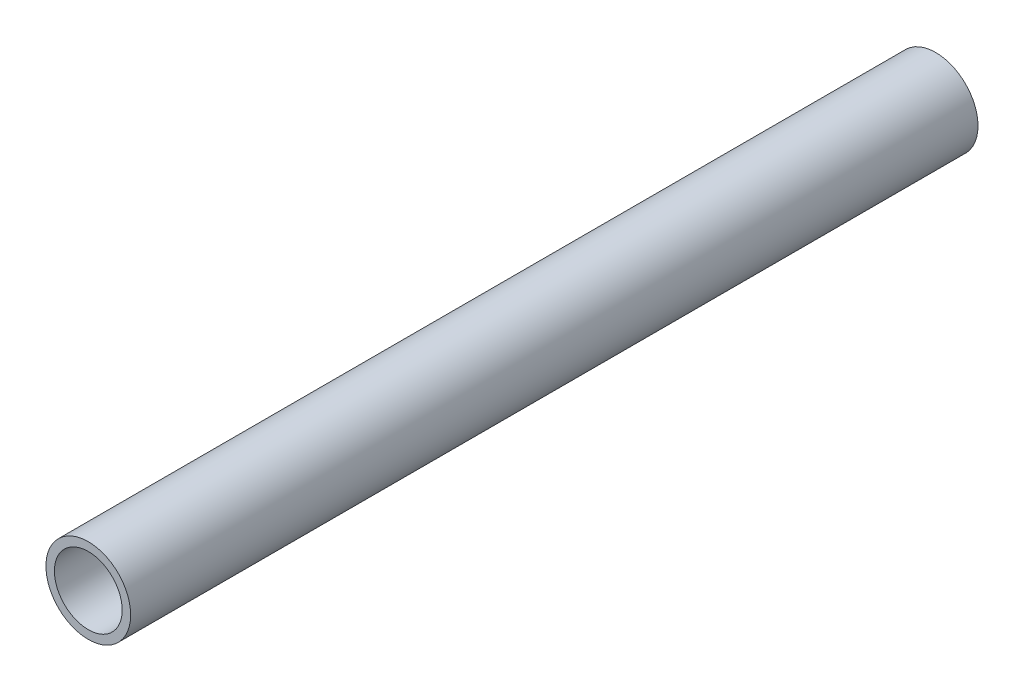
ISO-10303-21;
HEADER;
FILE_DESCRIPTION(('STEP AP214'),'2;1');
FILE_NAME('part.step','',(''),(''),'','','');
FILE_SCHEMA(('AUTOMOTIVE_DESIGN { 1 0 10303 214 1 1 1 1 }'));
ENDSEC;
DATA;
#1=APPLICATION_CONTEXT('core data for automotive mechanical design processes');
#2=APPLICATION_PROTOCOL_DEFINITION('international standard','automotive_design',2000,#1);
#3=PRODUCT_CONTEXT('',#1,'mechanical');
#4=PRODUCT('Part','Part','',(#3));
#5=PRODUCT_RELATED_PRODUCT_CATEGORY('part','',(#4));
#6=PRODUCT_DEFINITION_FORMATION('','',#4);
#7=PRODUCT_DEFINITION_CONTEXT('part definition',#1,'design');
#8=PRODUCT_DEFINITION('design','',#6,#7);
#9=PRODUCT_DEFINITION_SHAPE('','',#8);
#10=(LENGTH_UNIT() NAMED_UNIT(*) SI_UNIT(.MILLI.,.METRE.));
#11=(NAMED_UNIT(*) PLANE_ANGLE_UNIT() SI_UNIT($,.RADIAN.));
#12=(NAMED_UNIT(*) SI_UNIT($,.STERADIAN.) SOLID_ANGLE_UNIT());
#13=UNCERTAINTY_MEASURE_WITH_UNIT(LENGTH_MEASURE(1.E-05),#10,'distance_accuracy_value','');
#14=(GEOMETRIC_REPRESENTATION_CONTEXT(3) GLOBAL_UNCERTAINTY_ASSIGNED_CONTEXT((#13)) GLOBAL_UNIT_ASSIGNED_CONTEXT((#10,
#11,#12)) REPRESENTATION_CONTEXT('',''));
#15=CARTESIAN_POINT('',(0.,0.,0.));
#16=DIRECTION('',(0.,0.,1.));
#17=DIRECTION('',(1.,0.,0.));
#18=AXIS2_PLACEMENT_3D('',#15,#16,#17);
#19=CARTESIAN_POINT('',(-8.39466013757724,5.56499941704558,100.));
#20=DIRECTION('',(0.,0.,1.));
#21=DIRECTION('',(1.,0.,0.));
#22=AXIS2_PLACEMENT_3D('',#19,#20,#21);
#23=PLANE('',#22);
#24=CARTESIAN_POINT('',(-8.39466013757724,5.56499941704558,100.));
#25=DIRECTION('',(0.,0.,1.));
#26=DIRECTION('',(1.,0.,0.));
#27=AXIS2_PLACEMENT_3D('',#24,#25,#26);
#28=CIRCLE('',#27,5.);
#29=CARTESIAN_POINT('',(-3.39466013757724,5.56499941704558,100.));
#30=VERTEX_POINT('',#29);
#31=EDGE_CURVE('E10',#30,#30,#28,.T.);
#32=ORIENTED_EDGE('',*,*,#31,.T.);
#33=EDGE_LOOP('',(#32));
#34=FACE_BOUND('',#33,.T.);
#35=CARTESIAN_POINT('',(-8.39466013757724,5.56499941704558,100.));
#36=DIRECTION('',(0.,0.,1.));
#37=DIRECTION('',(1.,0.,0.));
#38=AXIS2_PLACEMENT_3D('',#35,#36,#37);
#39=CIRCLE('',#38,4.);
#40=CARTESIAN_POINT('',(-4.39466013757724,5.56499941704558,100.));
#41=VERTEX_POINT('',#40);
#42=EDGE_CURVE('E39',#41,#41,#39,.T.);
#43=ORIENTED_EDGE('',*,*,#42,.F.);
#44=EDGE_LOOP('',(#43));
#45=FACE_BOUND('',#44,.T.);
#46=ADVANCED_FACE('F28',(#34,#45),#23,.T.);
#47=CARTESIAN_POINT('',(-8.39466013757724,5.56499941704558,0.));
#48=DIRECTION('',(0.,0.,1.));
#49=DIRECTION('',(1.,0.,0.));
#50=AXIS2_PLACEMENT_3D('',#47,#48,#49);
#51=PLANE('',#50);
#52=CARTESIAN_POINT('',(-8.39466013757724,5.56499941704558,0.));
#53=DIRECTION('',(0.,0.,1.));
#54=DIRECTION('',(1.,0.,0.));
#55=AXIS2_PLACEMENT_3D('',#52,#53,#54);
#56=CIRCLE('',#55,5.);
#57=CARTESIAN_POINT('',(-3.39466013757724,5.56499941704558,0.));
#58=VERTEX_POINT('',#57);
#59=EDGE_CURVE('E32',#58,#58,#56,.T.);
#60=ORIENTED_EDGE('',*,*,#59,.F.);
#61=EDGE_LOOP('',(#60));
#62=FACE_BOUND('',#61,.T.);
#63=CARTESIAN_POINT('',(-8.39466013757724,5.56499941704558,0.));
#64=DIRECTION('',(0.,0.,1.));
#65=DIRECTION('',(1.,0.,0.));
#66=AXIS2_PLACEMENT_3D('',#63,#64,#65);
#67=CIRCLE('',#66,4.);
#68=CARTESIAN_POINT('',(-4.39466013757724,5.56499941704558,0.));
#69=VERTEX_POINT('',#68);
#70=EDGE_CURVE('E41',#69,#69,#67,.T.);
#71=ORIENTED_EDGE('',*,*,#70,.T.);
#72=EDGE_LOOP('',(#71));
#73=FACE_BOUND('',#72,.T.);
#74=ADVANCED_FACE('F51',(#62,#73),#51,.F.);
#75=CARTESIAN_POINT('',(-8.39466013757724,5.56499941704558,100.));
#76=DIRECTION('',(0.,0.,-1.));
#77=DIRECTION('',(-1.,0.,0.));
#78=AXIS2_PLACEMENT_3D('',#75,#76,#77);
#79=CYLINDRICAL_SURFACE('',#78,5.);
#80=ORIENTED_EDGE('',*,*,#31,.F.);
#81=EDGE_LOOP('',(#80));
#82=FACE_BOUND('',#81,.T.);
#83=ORIENTED_EDGE('',*,*,#59,.T.);
#84=EDGE_LOOP('',(#83));
#85=FACE_BOUND('',#84,.T.);
#86=ADVANCED_FACE('F30',(#82,#85),#79,.T.);
#87=CARTESIAN_POINT('',(-8.39466013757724,5.56499941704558,100.));
#88=DIRECTION('',(0.,0.,-1.));
#89=DIRECTION('',(-1.,0.,0.));
#90=AXIS2_PLACEMENT_3D('',#87,#88,#89);
#91=CYLINDRICAL_SURFACE('',#90,4.);
#92=ORIENTED_EDGE('',*,*,#42,.T.);
#93=EDGE_LOOP('',(#92));
#94=FACE_BOUND('',#93,.T.);
#95=ORIENTED_EDGE('',*,*,#70,.F.);
#96=EDGE_LOOP('',(#95));
#97=FACE_BOUND('',#96,.T.);
#98=ADVANCED_FACE('F47',(#94,#97),#91,.F.);
#99=CLOSED_SHELL('',(#46,#74,#86,#98));
#100=MANIFOLD_SOLID_BREP('B2',#99);
#101=ADVANCED_BREP_SHAPE_REPRESENTATION('',(#18,#100),#14);
#102=SHAPE_DEFINITION_REPRESENTATION(#9,#101);
ENDSEC;
END-ISO-10303-21;
